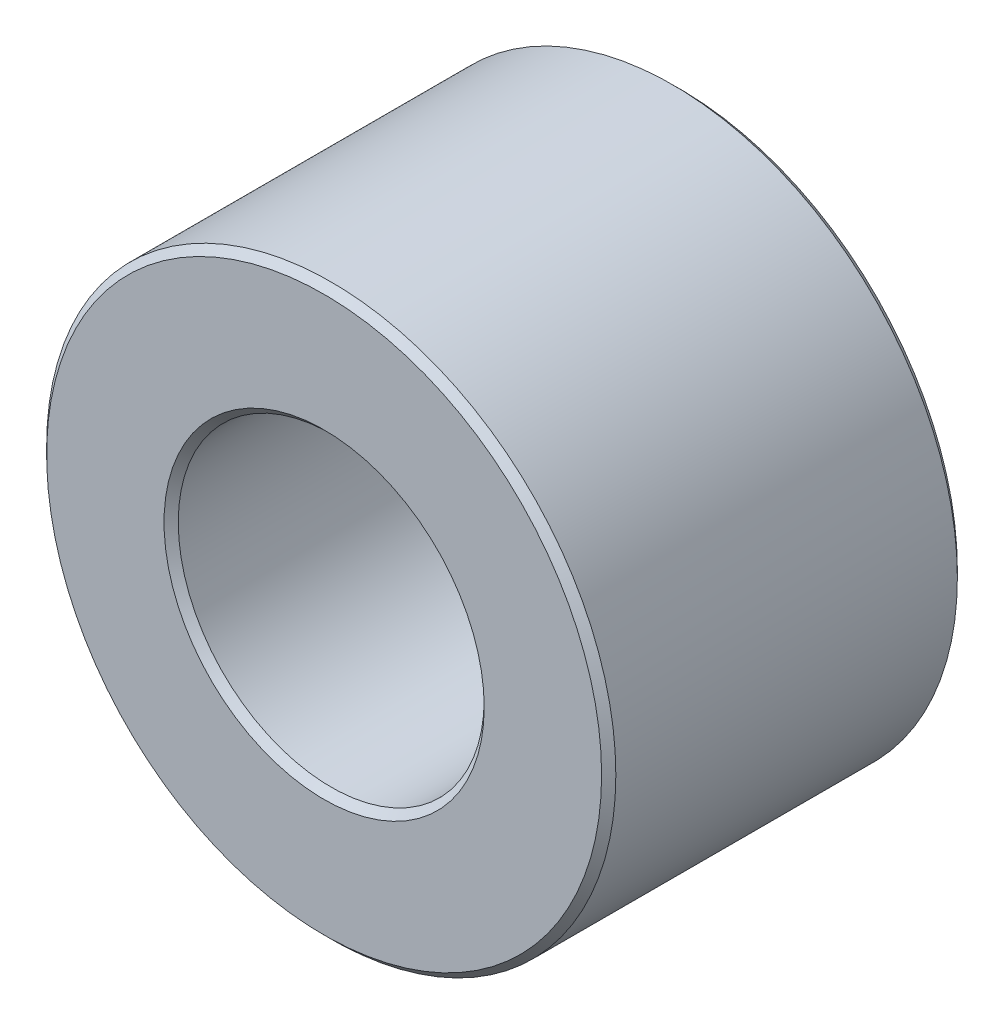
from build123d import *

# Parameters (mm, degrees)
SKETCH1_R           = 4
SKETCH1_R_2         = 2.15
BOSS_EXTRUDE2_DEPTH = 2.5
CHAMFER3_SIZE       = 0.1


with BuildPart() as part:
    # Sketch1 → Boss-Extrude2 (new, symmetric)
    with BuildSketch(Plane.XY):
        Circle(SKETCH1_R)
        Circle(SKETCH1_R_2, mode=Mode.SUBTRACT)
    extrude(amount=BOSS_EXTRUDE2_DEPTH, both=True)

    # Chamfer3
    chamfer3_edges = [part.edges().sort_by_distance(p)[0] for p in [
        (-4, 0, -2.5),
        (-4, 0, 2.5),
        (-2.15, 0, -2.5),
        (-2.15, 0, 2.5),
    ]]
    chamfer(chamfer3_edges, length=CHAMFER3_SIZE)


solid = part.part
